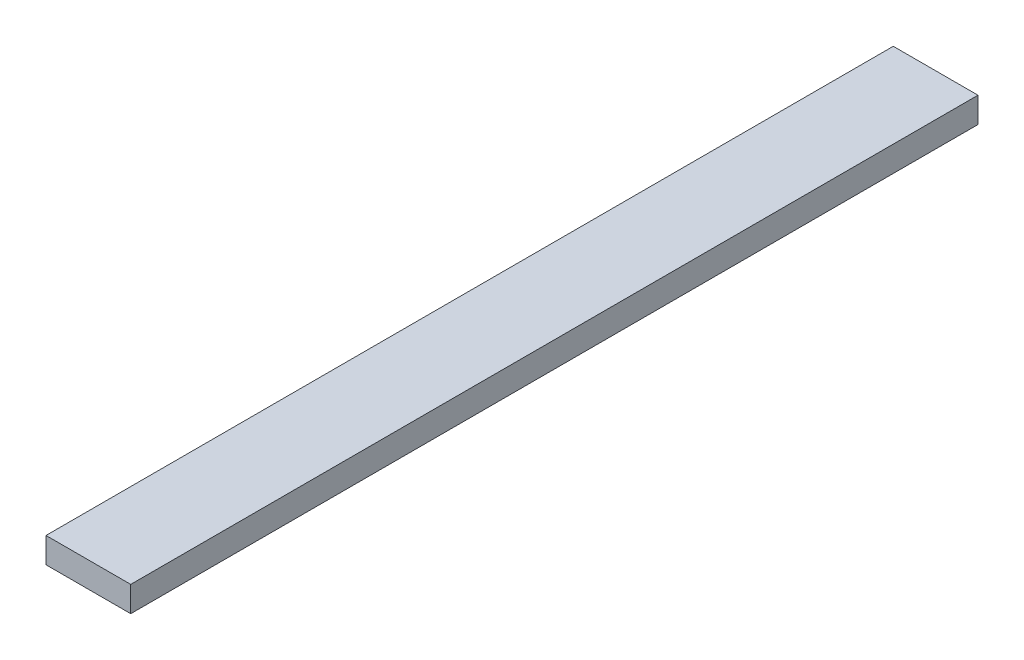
from build123d import *

# Parameters (mm, degrees)
CROQUIS2_W              = 500
CROQUIS2_H              = 15
SALIENTE_EXTRUIR1_DEPTH = 50


with BuildPart() as part:
    # Croquis2 → Saliente-Extruir1 (new body)
    with BuildSketch(Plane(origin=(0, 0, 0), x_dir=(0, 0, -1), z_dir=(1, 0, 0))):
        Rectangle(CROQUIS2_W, CROQUIS2_H)
    extrude(amount=SALIENTE_EXTRUIR1_DEPTH)


solid = part.part
